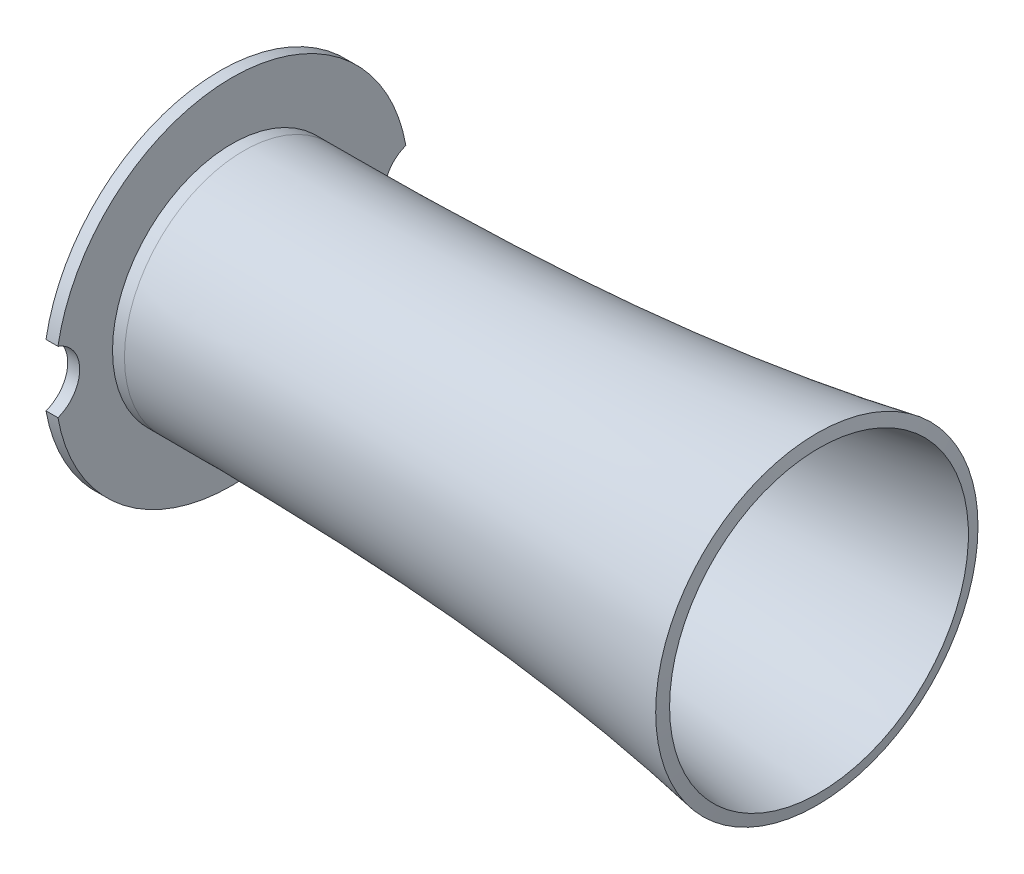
ISO-10303-21;
HEADER;
FILE_DESCRIPTION(('STEP AP214'),'2;1');
FILE_NAME('part.step','',(''),(''),'','','');
FILE_SCHEMA(('AUTOMOTIVE_DESIGN { 1 0 10303 214 1 1 1 1 }'));
ENDSEC;
DATA;
#1=APPLICATION_CONTEXT('core data for automotive mechanical design processes');
#2=APPLICATION_PROTOCOL_DEFINITION('international standard','automotive_design',2000,#1);
#3=PRODUCT_CONTEXT('',#1,'mechanical');
#4=PRODUCT('Part','Part','',(#3));
#5=PRODUCT_RELATED_PRODUCT_CATEGORY('part','',(#4));
#6=PRODUCT_DEFINITION_FORMATION('','',#4);
#7=PRODUCT_DEFINITION_CONTEXT('part definition',#1,'design');
#8=PRODUCT_DEFINITION('design','',#6,#7);
#9=PRODUCT_DEFINITION_SHAPE('','',#8);
#10=(LENGTH_UNIT() NAMED_UNIT(*) SI_UNIT(.MILLI.,.METRE.));
#11=(NAMED_UNIT(*) PLANE_ANGLE_UNIT() SI_UNIT($,.RADIAN.));
#12=(NAMED_UNIT(*) SI_UNIT($,.STERADIAN.) SOLID_ANGLE_UNIT());
#13=UNCERTAINTY_MEASURE_WITH_UNIT(LENGTH_MEASURE(1.E-05),#10,'distance_accuracy_value','');
#14=(GEOMETRIC_REPRESENTATION_CONTEXT(3) GLOBAL_UNCERTAINTY_ASSIGNED_CONTEXT((#13)) GLOBAL_UNIT_ASSIGNED_CONTEXT((#10,
#11,#12)) REPRESENTATION_CONTEXT('',''));
#15=CARTESIAN_POINT('',(0.,0.,0.));
#16=DIRECTION('',(0.,0.,1.));
#17=DIRECTION('',(1.,0.,0.));
#18=AXIS2_PLACEMENT_3D('',#15,#16,#17);
#19=CARTESIAN_POINT('',(0.,0.,0.));
#20=DIRECTION('',(-1.,0.,0.));
#21=DIRECTION('',(0.,0.,1.));
#22=AXIS2_PLACEMENT_3D('',#19,#20,#21);
#23=CYLINDRICAL_SURFACE('',#22,14.8);
#24=CARTESIAN_POINT('',(0.,0.,0.));
#25=DIRECTION('',(-1.,0.,0.));
#26=DIRECTION('',(0.,0.,1.));
#27=AXIS2_PLACEMENT_3D('',#24,#25,#26);
#28=CIRCLE('',#27,14.8);
#29=CARTESIAN_POINT('',(0.,2.58863797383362,14.5718548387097));
#30=VERTEX_POINT('',#29);
#31=CARTESIAN_POINT('',(0.,2.5886379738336,-14.5718548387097));
#32=VERTEX_POINT('',#31);
#33=EDGE_CURVE('E92',#30,#32,#28,.T.);
#34=ORIENTED_EDGE('',*,*,#33,.F.);
#35=DIRECTION('',(-1.,0.,0.));
#36=VECTOR('',#35,1.);
#37=CARTESIAN_POINT('',(0.5,2.58863797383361,14.5718548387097));
#38=LINE('',#37,#36);
#39=CARTESIAN_POINT('',(1.,2.58863797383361,14.5718548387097));
#40=VERTEX_POINT('',#39);
#41=EDGE_CURVE('E50',#40,#30,#38,.T.);
#42=ORIENTED_EDGE('',*,*,#41,.F.);
#43=CARTESIAN_POINT('',(1.,0.,0.));
#44=DIRECTION('',(-1.,0.,0.));
#45=DIRECTION('',(0.,0.,1.));
#46=AXIS2_PLACEMENT_3D('',#43,#44,#45);
#47=CIRCLE('',#46,14.8);
#48=CARTESIAN_POINT('',(1.,2.58863797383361,-14.5718548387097));
#49=VERTEX_POINT('',#48);
#50=EDGE_CURVE('E43',#40,#49,#47,.T.);
#51=ORIENTED_EDGE('',*,*,#50,.T.);
#52=DIRECTION('',(-1.,0.,0.));
#53=VECTOR('',#52,1.);
#54=CARTESIAN_POINT('',(0.5,2.58863797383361,-14.5718548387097));
#55=LINE('',#54,#53);
#56=EDGE_CURVE('E122',#32,#49,#55,.F.);
#57=ORIENTED_EDGE('',*,*,#56,.F.);
#58=EDGE_LOOP('',(#34,#42,#51,#57));
#59=FACE_BOUND('',#58,.T.);
#60=ADVANCED_FACE('F35',(#59),#23,.T.);
#61=CARTESIAN_POINT('',(1.,-2.58863797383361,-14.5718548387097));
#62=VERTEX_POINT('',#61);
#63=CARTESIAN_POINT('',(1.,-2.58863797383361,14.5718548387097));
#64=VERTEX_POINT('',#63);
#65=EDGE_CURVE('E11',#62,#64,#47,.T.);
#66=ORIENTED_EDGE('',*,*,#65,.T.);
#67=DIRECTION('',(-1.,0.,0.));
#68=VECTOR('',#67,1.);
#69=CARTESIAN_POINT('',(0.5,-2.58863797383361,14.5718548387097));
#70=LINE('',#69,#68);
#71=CARTESIAN_POINT('',(0.,-2.5886379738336,14.5718548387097));
#72=VERTEX_POINT('',#71);
#73=EDGE_CURVE('E77',#72,#64,#70,.F.);
#74=ORIENTED_EDGE('',*,*,#73,.F.);
#75=CARTESIAN_POINT('',(0.,-2.58863797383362,-14.5718548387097));
#76=VERTEX_POINT('',#75);
#77=EDGE_CURVE('E86',#76,#72,#28,.T.);
#78=ORIENTED_EDGE('',*,*,#77,.F.);
#79=DIRECTION('',(-1.,0.,0.));
#80=VECTOR('',#79,1.);
#81=CARTESIAN_POINT('',(0.5,-2.58863797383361,-14.5718548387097));
#82=LINE('',#81,#80);
#83=EDGE_CURVE('E58',#62,#76,#82,.T.);
#84=ORIENTED_EDGE('',*,*,#83,.F.);
#85=EDGE_LOOP('',(#66,#74,#78,#84));
#86=FACE_BOUND('',#85,.T.);
#87=ADVANCED_FACE('F37',(#86),#23,.T.);
#88=CARTESIAN_POINT('',(1.,14.8,0.));
#89=DIRECTION('',(-1.,0.,0.));
#90=DIRECTION('',(0.,0.,1.));
#91=AXIS2_PLACEMENT_3D('',#88,#89,#90);
#92=PLANE('',#91);
#93=ORIENTED_EDGE('',*,*,#50,.F.);
#94=CARTESIAN_POINT('',(1.,0.,15.5));
#95=DIRECTION('',(-1.,0.,0.));
#96=DIRECTION('',(0.,0.,1.));
#97=AXIS2_PLACEMENT_3D('',#94,#95,#96);
#98=CIRCLE('',#97,2.75);
#99=EDGE_CURVE('E82',#64,#40,#98,.F.);
#100=ORIENTED_EDGE('',*,*,#99,.F.);
#101=ORIENTED_EDGE('',*,*,#65,.F.);
#102=CARTESIAN_POINT('',(1.,0.,-15.5));
#103=DIRECTION('',(-1.,0.,0.));
#104=DIRECTION('',(0.,0.,1.));
#105=AXIS2_PLACEMENT_3D('',#102,#103,#104);
#106=CIRCLE('',#105,2.75);
#107=EDGE_CURVE('E97',#49,#62,#106,.F.);
#108=ORIENTED_EDGE('',*,*,#107,.F.);
#109=EDGE_LOOP('',(#93,#100,#101,#108));
#110=FACE_BOUND('',#109,.T.);
#111=CARTESIAN_POINT('',(1.,0.,0.));
#112=DIRECTION('',(-1.,0.,0.));
#113=DIRECTION('',(0.,0.,1.));
#114=AXIS2_PLACEMENT_3D('',#111,#112,#113);
#115=CIRCLE('',#114,10.);
#116=CARTESIAN_POINT('',(1.,0.,10.));
#117=VERTEX_POINT('',#116);
#118=EDGE_CURVE('E114',#117,#117,#115,.T.);
#119=ORIENTED_EDGE('',*,*,#118,.T.);
#120=EDGE_LOOP('',(#119));
#121=FACE_BOUND('',#120,.T.);
#122=ADVANCED_FACE('F127',(#110,#121),#92,.F.);
#123=CARTESIAN_POINT('',(0.,0.,0.));
#124=DIRECTION('',(-1.,0.,0.));
#125=DIRECTION('',(0.,0.,1.));
#126=AXIS2_PLACEMENT_3D('',#123,#124,#125);
#127=CYLINDRICAL_SURFACE('',#126,10.);
#128=ORIENTED_EDGE('',*,*,#118,.F.);
#129=EDGE_LOOP('',(#128));
#130=FACE_BOUND('',#129,.T.);
#131=CARTESIAN_POINT('',(2.,0.,0.));
#132=DIRECTION('',(-1.,0.,0.));
#133=DIRECTION('',(0.,0.,1.));
#134=AXIS2_PLACEMENT_3D('',#131,#132,#133);
#135=CIRCLE('',#134,10.);
#136=CARTESIAN_POINT('',(2.,0.,10.));
#137=VERTEX_POINT('',#136);
#138=EDGE_CURVE('E112',#137,#137,#135,.T.);
#139=ORIENTED_EDGE('',*,*,#138,.T.);
#140=EDGE_LOOP('',(#139));
#141=FACE_BOUND('',#140,.T.);
#142=ADVANCED_FACE('F151',(#130,#141),#127,.T.);
#143=CARTESIAN_POINT('',(50.,13.5,0.));
#144=CARTESIAN_POINT('',(33.6879746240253,10.5033925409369,0.));
#145=CARTESIAN_POINT('',(18.0424783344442,10.,0.));
#146=CARTESIAN_POINT('',(2.,10.,0.));
#147=B_SPLINE_CURVE_WITH_KNOTS('',3,(#143,#144,#145,#146),.UNSPECIFIED.,.F.,.F.,(4,4),(0.,1.),.UNSPECIFIED.);
#148=CARTESIAN_POINT('',(0.,0.,0.));
#149=DIRECTION('',(-1.,0.,0.));
#150=AXIS1_PLACEMENT('',#148,#149);
#151=SURFACE_OF_REVOLUTION('',#147,#150);
#152=ORIENTED_EDGE('',*,*,#138,.F.);
#153=EDGE_LOOP('',(#152));
#154=FACE_BOUND('',#153,.T.);
#155=CARTESIAN_POINT('',(50.,0.,0.));
#156=DIRECTION('',(-1.,0.,0.));
#157=DIRECTION('',(0.,0.,1.));
#158=AXIS2_PLACEMENT_3D('',#155,#156,#157);
#159=CIRCLE('',#158,13.5);
#160=CARTESIAN_POINT('',(50.,0.,13.5));
#161=VERTEX_POINT('',#160);
#162=EDGE_CURVE('E109',#161,#161,#159,.T.);
#163=ORIENTED_EDGE('',*,*,#162,.T.);
#164=EDGE_LOOP('',(#163));
#165=FACE_BOUND('',#164,.T.);
#166=ADVANCED_FACE('F147',(#154,#165),#151,.T.);
#167=CARTESIAN_POINT('',(50.1806819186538,0.,0.));
#168=DIRECTION('',(-1.,0.,0.));
#169=DIRECTION('',(0.,0.,1.));
#170=AXIS2_PLACEMENT_3D('',#167,#168,#169);
#171=CONICAL_SURFACE('',#170,12.5164584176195,1.38911658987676);
#172=ORIENTED_EDGE('',*,*,#162,.F.);
#173=EDGE_LOOP('',(#172));
#174=FACE_BOUND('',#173,.T.);
#175=CARTESIAN_POINT('',(50.1806819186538,0.,0.));
#176=DIRECTION('',(-1.,0.,0.));
#177=DIRECTION('',(0.,0.,1.));
#178=AXIS2_PLACEMENT_3D('',#175,#176,#177);
#179=CIRCLE('',#178,12.5164584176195);
#180=CARTESIAN_POINT('',(50.1806819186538,0.,12.5164584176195));
#181=VERTEX_POINT('',#180);
#182=EDGE_CURVE('E106',#181,#181,#179,.T.);
#183=ORIENTED_EDGE('',*,*,#182,.T.);
#184=EDGE_LOOP('',(#183));
#185=FACE_BOUND('',#184,.T.);
#186=ADVANCED_FACE('F142',(#174,#185),#171,.T.);
#187=CARTESIAN_POINT('',(2.,9.,0.));
#188=CARTESIAN_POINT('',(5.99944349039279,9.,0.));
#189=CARTESIAN_POINT('',(14.0112887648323,9.0630606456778,0.));
#190=CARTESIAN_POINT('',(25.9473525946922,9.53382548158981,0.));
#191=CARTESIAN_POINT('',(35.9657955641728,10.3982253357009,0.));
#192=CARTESIAN_POINT('',(44.0431964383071,11.4634853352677,0.));
#193=CARTESIAN_POINT('',(48.1463339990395,12.1427376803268,0.));
#194=CARTESIAN_POINT('',(50.1806819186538,12.5164584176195,0.));
#195=B_SPLINE_CURVE_WITH_KNOTS('',3,(#187,#188,#189,#190,#191,#192,#193,#194),.UNSPECIFIED.,.F.,
.F.,(4,1,1,1,1,4),(0.,0.25,0.5,0.75,0.875,1.),.UNSPECIFIED.);
#196=CARTESIAN_POINT('',(0.,0.,0.));
#197=DIRECTION('',(-1.,0.,0.));
#198=AXIS1_PLACEMENT('',#196,#197);
#199=SURFACE_OF_REVOLUTION('',#195,#198);
#200=ORIENTED_EDGE('',*,*,#182,.F.);
#201=EDGE_LOOP('',(#200));
#202=FACE_BOUND('',#201,.T.);
#203=CARTESIAN_POINT('',(2.,0.,0.));
#204=DIRECTION('',(-1.,0.,0.));
#205=DIRECTION('',(0.,0.,1.));
#206=AXIS2_PLACEMENT_3D('',#203,#204,#205);
#207=CIRCLE('',#206,9.);
#208=CARTESIAN_POINT('',(2.,0.,9.));
#209=VERTEX_POINT('',#208);
#210=EDGE_CURVE('E95',#209,#209,#207,.T.);
#211=ORIENTED_EDGE('',*,*,#210,.T.);
#212=EDGE_LOOP('',(#211));
#213=FACE_BOUND('',#212,.T.);
#214=ADVANCED_FACE('F137',(#202,#213),#199,.T.);
#215=CARTESIAN_POINT('',(0.,0.,0.));
#216=DIRECTION('',(-1.,0.,0.));
#217=DIRECTION('',(0.,0.,1.));
#218=AXIS2_PLACEMENT_3D('',#215,#216,#217);
#219=CYLINDRICAL_SURFACE('',#218,9.);
#220=ORIENTED_EDGE('',*,*,#210,.F.);
#221=EDGE_LOOP('',(#220));
#222=FACE_BOUND('',#221,.T.);
#223=CARTESIAN_POINT('',(0.,0.,0.));
#224=DIRECTION('',(-1.,0.,0.));
#225=DIRECTION('',(0.,0.,1.));
#226=AXIS2_PLACEMENT_3D('',#223,#224,#225);
#227=CIRCLE('',#226,9.);
#228=CARTESIAN_POINT('',(0.,0.,9.));
#229=VERTEX_POINT('',#228);
#230=EDGE_CURVE('E91',#229,#229,#227,.T.);
#231=ORIENTED_EDGE('',*,*,#230,.T.);
#232=EDGE_LOOP('',(#231));
#233=FACE_BOUND('',#232,.T.);
#234=ADVANCED_FACE('F141',(#222,#233),#219,.F.);
#235=CARTESIAN_POINT('',(0.,14.8,0.));
#236=DIRECTION('',(1.,0.,0.));
#237=DIRECTION('',(0.,0.,-1.));
#238=AXIS2_PLACEMENT_3D('',#235,#236,#237);
#239=PLANE('',#238);
#240=ORIENTED_EDGE('',*,*,#230,.F.);
#241=EDGE_LOOP('',(#240));
#242=FACE_BOUND('',#241,.T.);
#243=ORIENTED_EDGE('',*,*,#77,.T.);
#244=CARTESIAN_POINT('',(0.,0.,15.5));
#245=DIRECTION('',(-1.,0.,0.));
#246=DIRECTION('',(0.,0.,1.));
#247=AXIS2_PLACEMENT_3D('',#244,#245,#246);
#248=CIRCLE('',#247,2.75);
#249=EDGE_CURVE('E74',#30,#72,#248,.T.);
#250=ORIENTED_EDGE('',*,*,#249,.F.);
#251=ORIENTED_EDGE('',*,*,#33,.T.);
#252=CARTESIAN_POINT('',(0.,0.,-15.5));
#253=DIRECTION('',(-1.,0.,0.));
#254=DIRECTION('',(0.,0.,1.));
#255=AXIS2_PLACEMENT_3D('',#252,#253,#254);
#256=CIRCLE('',#255,2.75);
#257=EDGE_CURVE('E90',#76,#32,#256,.T.);
#258=ORIENTED_EDGE('',*,*,#257,.F.);
#259=EDGE_LOOP('',(#243,#250,#251,#258));
#260=FACE_BOUND('',#259,.T.);
#261=ADVANCED_FACE('F89',(#242,#260),#239,.F.);
#262=CARTESIAN_POINT('',(50.1816819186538,0.,-15.5));
#263=DIRECTION('',(-1.,0.,0.));
#264=DIRECTION('',(0.,0.,1.));
#265=AXIS2_PLACEMENT_3D('',#262,#263,#264);
#266=CYLINDRICAL_SURFACE('',#265,2.75);
#267=ORIENTED_EDGE('',*,*,#56,.T.);
#268=ORIENTED_EDGE('',*,*,#107,.T.);
#269=ORIENTED_EDGE('',*,*,#83,.T.);
#270=ORIENTED_EDGE('',*,*,#257,.T.);
#271=EDGE_LOOP('',(#267,#268,#269,#270));
#272=FACE_BOUND('',#271,.T.);
#273=ADVANCED_FACE('F125',(#272),#266,.F.);
#274=CARTESIAN_POINT('',(50.1816819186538,0.,15.5));
#275=DIRECTION('',(-1.,0.,0.));
#276=DIRECTION('',(0.,0.,1.));
#277=AXIS2_PLACEMENT_3D('',#274,#275,#276);
#278=CYLINDRICAL_SURFACE('',#277,2.75);
#279=ORIENTED_EDGE('',*,*,#73,.T.);
#280=ORIENTED_EDGE('',*,*,#99,.T.);
#281=ORIENTED_EDGE('',*,*,#41,.T.);
#282=ORIENTED_EDGE('',*,*,#249,.T.);
#283=EDGE_LOOP('',(#279,#280,#281,#282));
#284=FACE_BOUND('',#283,.T.);
#285=ADVANCED_FACE('F76',(#284),#278,.F.);
#286=CLOSED_SHELL('',(#60,#87,#122,#142,#166,#186,#214,#234,#261,#273,#285));
#287=MANIFOLD_SOLID_BREP('B2',#286);
#288=ADVANCED_BREP_SHAPE_REPRESENTATION('',(#18,#287),#14);
#289=SHAPE_DEFINITION_REPRESENTATION(#9,#288);
ENDSEC;
END-ISO-10303-21;
